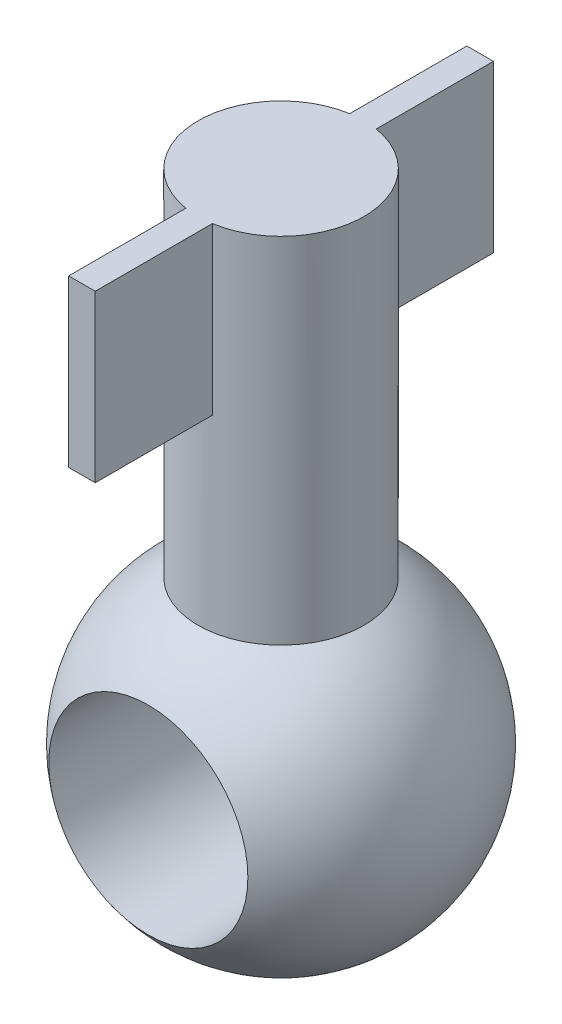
from build123d import *

# Parameters (mm, degrees)
EXTRUDE1_REACH             = 63.237
EXTRUDE1_END_RADIUS        = 25
SKETCH2_R                  = 12.5
EXTRUDE1_DIRECTION_2_DEPTH = 50
EXTRUDE2_DEPTH             = 83.915619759
EXTRUDE2_DEPTH_BACK        = 83.915619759
SKETCH3_R                  = 15
EXTRUDE3_DEPTH             = 30
EXTRUDE3_DEPTH_BACK        = 30
SKETCH4_W                  = 4
SKETCH4_H                  = 25


with BuildPart() as part:
    # Sketch1 → Revolve1 (revolve)
    with BuildSketch(Plane.XY):
        with BuildLine():
            Line((0, 25), (0, -25))
            ThreePointArc((0, -25), (-25, 0), (0, 25))
        make_face()
    revolve(axis=Axis((0, 42.006777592, 0), (0, -1, 0)))

    # Extrude1: up to this sphere (the profile starts outside it)
    extrude1_end = Location((0, 0, 0)) * Sphere(EXTRUDE1_END_RADIUS, mode=Mode.PRIVATE)
    # Sketch2 → Extrude1 (add, up to the surface)
    with BuildSketch(Plane(origin=(0, 25, 0), x_dir=(-1, 0, 0), z_dir=(0, 1, 0)), mode=Mode.PRIVATE) as extrude1_sk1:
        with Locations(Location((0, 0, 0), (0, 0, 90))):
            Circle(SKETCH2_R)
    extrude1_tool1 = extrude(extrude1_sk1.sketch, amount=-EXTRUDE1_REACH, mode=Mode.PRIVATE) - extrude1_end
    add(extrude1_tool1.solids().sort_by_distance((0, 25, 0))[0])

    # Sketch2 → Extrude1 direction 2 (add)
    with BuildSketch(Plane(origin=(0, 25, 0), x_dir=(-1, 0, 0), z_dir=(0, 1, 0))):
        with Locations(Location((0, 0, 0), (0, 0, 90))):
            Circle(SKETCH2_R)
    extrude(amount=EXTRUDE1_DIRECTION_2_DEPTH)

    # Sketch3 → Extrude2 (cut, two sides: drawn at the far end of the back side and taken through both)
    with BuildSketch(Plane.XY.offset(-EXTRUDE2_DEPTH_BACK)):
        Circle(SKETCH3_R)
    extrude(amount=EXTRUDE2_DEPTH + EXTRUDE2_DEPTH_BACK, mode=Mode.SUBTRACT)

    # Sketch4 → Extrude3 (add, two sides: drawn at the far end of the back side and taken through both)
    with BuildSketch(Plane.XY.offset(-EXTRUDE3_DEPTH_BACK)):
        with Locations((0, 62.5)):
            Rectangle(SKETCH4_W, SKETCH4_H)
    extrude(amount=EXTRUDE3_DEPTH + EXTRUDE3_DEPTH_BACK)


solid = part.part
